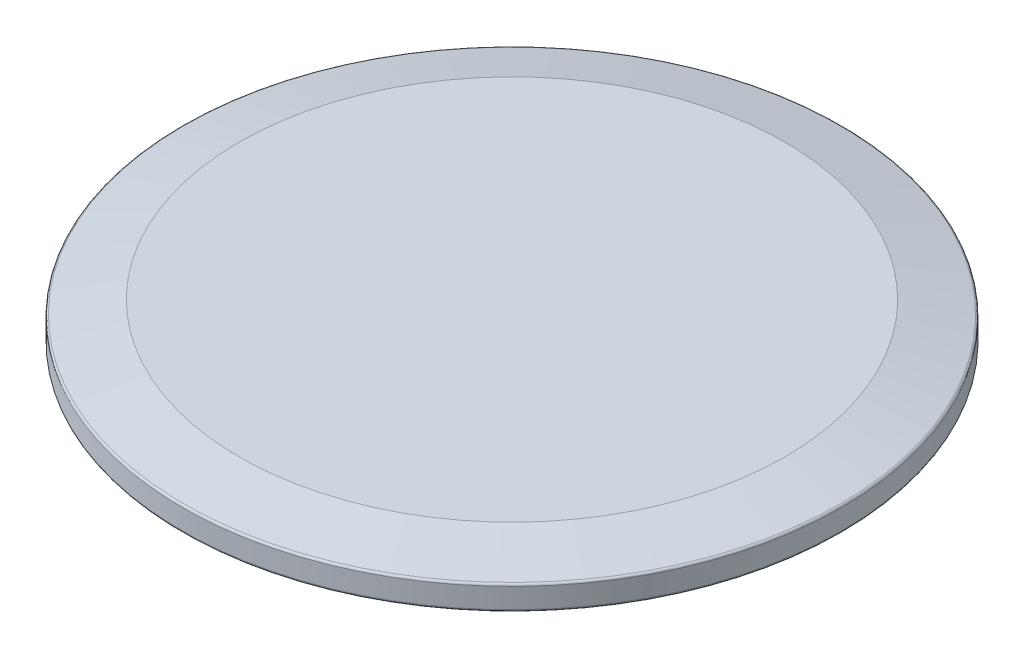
ISO-10303-21;
HEADER;
FILE_DESCRIPTION(('STEP AP214'),'2;1');
FILE_NAME('part.step','',(''),(''),'','','');
FILE_SCHEMA(('AUTOMOTIVE_DESIGN { 1 0 10303 214 1 1 1 1 }'));
ENDSEC;
DATA;
#1=APPLICATION_CONTEXT('core data for automotive mechanical design processes');
#2=APPLICATION_PROTOCOL_DEFINITION('international standard','automotive_design',2000,#1);
#3=PRODUCT_CONTEXT('',#1,'mechanical');
#4=PRODUCT('Part','Part','',(#3));
#5=PRODUCT_RELATED_PRODUCT_CATEGORY('part','',(#4));
#6=PRODUCT_DEFINITION_FORMATION('','',#4);
#7=PRODUCT_DEFINITION_CONTEXT('part definition',#1,'design');
#8=PRODUCT_DEFINITION('design','',#6,#7);
#9=PRODUCT_DEFINITION_SHAPE('','',#8);
#10=(LENGTH_UNIT() NAMED_UNIT(*) SI_UNIT(.MILLI.,.METRE.));
#11=(NAMED_UNIT(*) PLANE_ANGLE_UNIT() SI_UNIT($,.RADIAN.));
#12=(NAMED_UNIT(*) SI_UNIT($,.STERADIAN.) SOLID_ANGLE_UNIT());
#13=UNCERTAINTY_MEASURE_WITH_UNIT(LENGTH_MEASURE(1.E-05),#10,'distance_accuracy_value','');
#14=(GEOMETRIC_REPRESENTATION_CONTEXT(3) GLOBAL_UNCERTAINTY_ASSIGNED_CONTEXT((#13)) GLOBAL_UNIT_ASSIGNED_CONTEXT((#10,
#11,#12)) REPRESENTATION_CONTEXT('',''));
#15=CARTESIAN_POINT('',(0.,0.,0.));
#16=DIRECTION('',(0.,0.,1.));
#17=DIRECTION('',(1.,0.,0.));
#18=AXIS2_PLACEMENT_3D('',#15,#16,#17);
#19=CARTESIAN_POINT('',(0.,0.299999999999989,0.));
#20=DIRECTION('',(0.,1.,0.));
#21=DIRECTION('',(-1.,0.,0.));
#22=AXIS2_PLACEMENT_3D('',#19,#20,#21);
#23=TOROIDAL_SURFACE('',#22,35.55,0.3);
#24=CARTESIAN_POINT('',(0.,0.,0.));
#25=DIRECTION('',(0.,1.,0.));
#26=DIRECTION('',(-1.,0.,0.));
#27=AXIS2_PLACEMENT_3D('',#24,#25,#26);
#28=CIRCLE('',#27,35.55);
#29=CARTESIAN_POINT('',(-35.55,0.,0.));
#30=VERTEX_POINT('',#29);
#31=EDGE_CURVE('E52',#30,#30,#28,.T.);
#32=ORIENTED_EDGE('',*,*,#31,.F.);
#33=EDGE_LOOP('',(#32));
#34=FACE_BOUND('',#33,.T.);
#35=CARTESIAN_POINT('',(0.,0.299999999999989,0.));
#36=DIRECTION('',(0.,1.,0.));
#37=DIRECTION('',(-1.,0.,0.));
#38=AXIS2_PLACEMENT_3D('',#35,#36,#37);
#39=CIRCLE('',#38,35.25);
#40=CARTESIAN_POINT('',(-35.25,0.299999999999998,0.));
#41=VERTEX_POINT('',#40);
#42=EDGE_CURVE('E10',#41,#41,#39,.F.);
#43=ORIENTED_EDGE('',*,*,#42,.F.);
#44=EDGE_LOOP('',(#43));
#45=FACE_BOUND('',#44,.T.);
#46=ADVANCED_FACE('F45',(#34,#45),#23,.T.);
#47=CARTESIAN_POINT('',(0.,0.299999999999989,0.));
#48=DIRECTION('',(0.,1.,0.));
#49=DIRECTION('',(-1.,0.,0.));
#50=AXIS2_PLACEMENT_3D('',#47,#48,#49);
#51=TOROIDAL_SURFACE('',#50,43.2,0.3);
#52=CARTESIAN_POINT('',(0.,0.299999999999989,0.));
#53=DIRECTION('',(0.,1.,0.));
#54=DIRECTION('',(-1.,0.,0.));
#55=AXIS2_PLACEMENT_3D('',#52,#53,#54);
#56=CIRCLE('',#55,43.5);
#57=CARTESIAN_POINT('',(-43.5,0.3,0.));
#58=VERTEX_POINT('',#57);
#59=EDGE_CURVE('E62',#58,#58,#56,.T.);
#60=ORIENTED_EDGE('',*,*,#59,.F.);
#61=EDGE_LOOP('',(#60));
#62=FACE_BOUND('',#61,.T.);
#63=CARTESIAN_POINT('',(0.,0.,0.));
#64=DIRECTION('',(0.,1.,0.));
#65=DIRECTION('',(-1.,0.,0.));
#66=AXIS2_PLACEMENT_3D('',#63,#64,#65);
#67=CIRCLE('',#66,43.2);
#68=CARTESIAN_POINT('',(-43.2,0.,0.));
#69=VERTEX_POINT('',#68);
#70=EDGE_CURVE('E57',#69,#69,#67,.F.);
#71=ORIENTED_EDGE('',*,*,#70,.F.);
#72=EDGE_LOOP('',(#71));
#73=FACE_BOUND('',#72,.T.);
#74=ADVANCED_FACE('F108',(#62,#73),#51,.T.);
#75=CARTESIAN_POINT('',(0.,2.96348095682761,0.));
#76=DIRECTION('',(0.,-1.,0.));
#77=DIRECTION('',(1.,0.,0.));
#78=AXIS2_PLACEMENT_3D('',#75,#76,#77);
#79=TOROIDAL_SURFACE('',#78,43.2,0.3);
#80=CARTESIAN_POINT('',(0.,3.25519714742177,0.));
#81=DIRECTION('',(0.,1.,0.));
#82=DIRECTION('',(-1.,0.,0.));
#83=AXIS2_PLACEMENT_3D('',#80,#81,#82);
#84=CIRCLE('',#83,43.2700118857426);
#85=CARTESIAN_POINT('',(-43.2700118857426,3.25519714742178,0.));
#86=VERTEX_POINT('',#85);
#87=EDGE_CURVE('E72',#86,#86,#84,.T.);
#88=ORIENTED_EDGE('',*,*,#87,.F.);
#89=EDGE_LOOP('',(#88));
#90=FACE_BOUND('',#89,.T.);
#91=CARTESIAN_POINT('',(0.,2.96348095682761,0.));
#92=DIRECTION('',(0.,-1.,0.));
#93=DIRECTION('',(1.,0.,0.));
#94=AXIS2_PLACEMENT_3D('',#91,#92,#93);
#95=CIRCLE('',#94,43.5);
#96=CARTESIAN_POINT('',(43.5,2.9634809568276,0.));
#97=VERTEX_POINT('',#96);
#98=EDGE_CURVE('E68',#97,#97,#95,.T.);
#99=ORIENTED_EDGE('',*,*,#98,.F.);
#100=EDGE_LOOP('',(#99));
#101=FACE_BOUND('',#100,.T.);
#102=ADVANCED_FACE('F98',(#90,#101),#79,.T.);
#103=CARTESIAN_POINT('',(0.,2.49999999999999,0.));
#104=DIRECTION('',(0.,-1.,0.));
#105=DIRECTION('',(1.,0.,0.));
#106=AXIS2_PLACEMENT_3D('',#103,#104,#105);
#107=PLANE('',#106);
#108=CARTESIAN_POINT('',(0.,2.49999999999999,0.));
#109=DIRECTION('',(0.,1.,0.));
#110=DIRECTION('',(-1.,0.,0.));
#111=AXIS2_PLACEMENT_3D('',#108,#109,#110);
#112=CIRCLE('',#111,31.75);
#113=CARTESIAN_POINT('',(-31.75,2.5,0.));
#114=VERTEX_POINT('',#113);
#115=EDGE_CURVE('E76',#114,#114,#112,.T.);
#116=ORIENTED_EDGE('',*,*,#115,.T.);
#117=EDGE_LOOP('',(#116));
#118=FACE_BOUND('',#117,.T.);
#119=CARTESIAN_POINT('',(0.,2.49999999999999,0.));
#120=DIRECTION('',(0.,1.,0.));
#121=DIRECTION('',(-1.,0.,0.));
#122=AXIS2_PLACEMENT_3D('',#119,#120,#121);
#123=CIRCLE('',#122,35.25);
#124=CARTESIAN_POINT('',(-35.25,2.5,0.));
#125=VERTEX_POINT('',#124);
#126=EDGE_CURVE('E88',#125,#125,#123,.T.);
#127=ORIENTED_EDGE('',*,*,#126,.F.);
#128=EDGE_LOOP('',(#127));
#129=FACE_BOUND('',#128,.T.);
#130=ADVANCED_FACE('F95',(#118,#129),#107,.T.);
#131=CARTESIAN_POINT('',(0.,5.,0.));
#132=DIRECTION('',(0.,1.,0.));
#133=DIRECTION('',(-1.,0.,0.));
#134=AXIS2_PLACEMENT_3D('',#131,#132,#133);
#135=CYLINDRICAL_SURFACE('',#134,31.75);
#136=CARTESIAN_POINT('',(0.,0.,0.));
#137=DIRECTION('',(0.,1.,0.));
#138=DIRECTION('',(-1.,0.,0.));
#139=AXIS2_PLACEMENT_3D('',#136,#137,#138);
#140=CIRCLE('',#139,31.75);
#141=CARTESIAN_POINT('',(-31.75,0.,0.));
#142=VERTEX_POINT('',#141);
#143=EDGE_CURVE('E80',#142,#142,#140,.T.);
#144=ORIENTED_EDGE('',*,*,#143,.T.);
#145=EDGE_LOOP('',(#144));
#146=FACE_BOUND('',#145,.T.);
#147=ORIENTED_EDGE('',*,*,#115,.F.);
#148=EDGE_LOOP('',(#147));
#149=FACE_BOUND('',#148,.T.);
#150=ADVANCED_FACE('F97',(#146,#149),#135,.T.);
#151=CARTESIAN_POINT('',(0.,0.,0.));
#152=DIRECTION('',(0.,1.,0.));
#153=DIRECTION('',(-1.,0.,0.));
#154=AXIS2_PLACEMENT_3D('',#151,#152,#153);
#155=PLANE('',#154);
#156=ORIENTED_EDGE('',*,*,#143,.F.);
#157=EDGE_LOOP('',(#156));
#158=FACE_BOUND('',#157,.T.);
#159=ADVANCED_FACE('F104',(#158),#155,.F.);
#160=CARTESIAN_POINT('',(0.,5.,0.));
#161=DIRECTION('',(0.,-1.,0.));
#162=DIRECTION('',(1.,0.,0.));
#163=AXIS2_PLACEMENT_3D('',#160,#161,#162);
#164=PLANE('',#163);
#165=CARTESIAN_POINT('',(0.,4.99999999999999,0.));
#166=DIRECTION('',(0.,1.,0.));
#167=DIRECTION('',(-1.,0.,0.));
#168=AXIS2_PLACEMENT_3D('',#165,#166,#167);
#169=CIRCLE('',#168,36.);
#170=CARTESIAN_POINT('',(-36.,5.,0.));
#171=VERTEX_POINT('',#170);
#172=EDGE_CURVE('E84',#171,#171,#169,.T.);
#173=ORIENTED_EDGE('',*,*,#172,.T.);
#174=EDGE_LOOP('',(#173));
#175=FACE_BOUND('',#174,.T.);
#176=ADVANCED_FACE('F139',(#175),#164,.F.);
#177=CARTESIAN_POINT('',(0.,3.19999999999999,0.));
#178=DIRECTION('',(0.,-1.,0.));
#179=DIRECTION('',(1.,0.,0.));
#180=AXIS2_PLACEMENT_3D('',#177,#178,#179);
#181=CONICAL_SURFACE('',#180,43.5,1.33525134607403);
#182=ORIENTED_EDGE('',*,*,#87,.T.);
#183=EDGE_LOOP('',(#182));
#184=FACE_BOUND('',#183,.T.);
#185=ORIENTED_EDGE('',*,*,#172,.F.);
#186=EDGE_LOOP('',(#185));
#187=FACE_BOUND('',#186,.T.);
#188=ADVANCED_FACE('F134',(#184,#187),#181,.T.);
#189=CARTESIAN_POINT('',(0.,5.,0.));
#190=DIRECTION('',(0.,1.,0.));
#191=DIRECTION('',(-1.,0.,0.));
#192=AXIS2_PLACEMENT_3D('',#189,#190,#191);
#193=CYLINDRICAL_SURFACE('',#192,43.5);
#194=ORIENTED_EDGE('',*,*,#59,.T.);
#195=EDGE_LOOP('',(#194));
#196=FACE_BOUND('',#195,.T.);
#197=ORIENTED_EDGE('',*,*,#98,.T.);
#198=EDGE_LOOP('',(#197));
#199=FACE_BOUND('',#198,.T.);
#200=ADVANCED_FACE('F128',(#196,#199),#193,.T.);
#201=CARTESIAN_POINT('',(0.,0.,0.));
#202=DIRECTION('',(0.,1.,0.));
#203=DIRECTION('',(-1.,0.,0.));
#204=AXIS2_PLACEMENT_3D('',#201,#202,#203);
#205=PLANE('',#204);
#206=ORIENTED_EDGE('',*,*,#31,.T.);
#207=EDGE_LOOP('',(#206));
#208=FACE_BOUND('',#207,.T.);
#209=ORIENTED_EDGE('',*,*,#70,.T.);
#210=EDGE_LOOP('',(#209));
#211=FACE_BOUND('',#210,.T.);
#212=ADVANCED_FACE('F127',(#208,#211),#205,.F.);
#213=CARTESIAN_POINT('',(0.,5.,0.));
#214=DIRECTION('',(0.,1.,0.));
#215=DIRECTION('',(-1.,0.,0.));
#216=AXIS2_PLACEMENT_3D('',#213,#214,#215);
#217=CYLINDRICAL_SURFACE('',#216,35.25);
#218=ORIENTED_EDGE('',*,*,#42,.T.);
#219=EDGE_LOOP('',(#218));
#220=FACE_BOUND('',#219,.T.);
#221=ORIENTED_EDGE('',*,*,#126,.T.);
#222=EDGE_LOOP('',(#221));
#223=FACE_BOUND('',#222,.T.);
#224=ADVANCED_FACE('F93',(#220,#223),#217,.F.);
#225=CLOSED_SHELL('',(#46,#74,#102,#130,#150,#159,#176,#188,#200,#212,#224));
#226=MANIFOLD_SOLID_BREP('B2',#225);
#227=ADVANCED_BREP_SHAPE_REPRESENTATION('',(#18,#226),#14);
#228=SHAPE_DEFINITION_REPRESENTATION(#9,#227);
ENDSEC;
END-ISO-10303-21;
